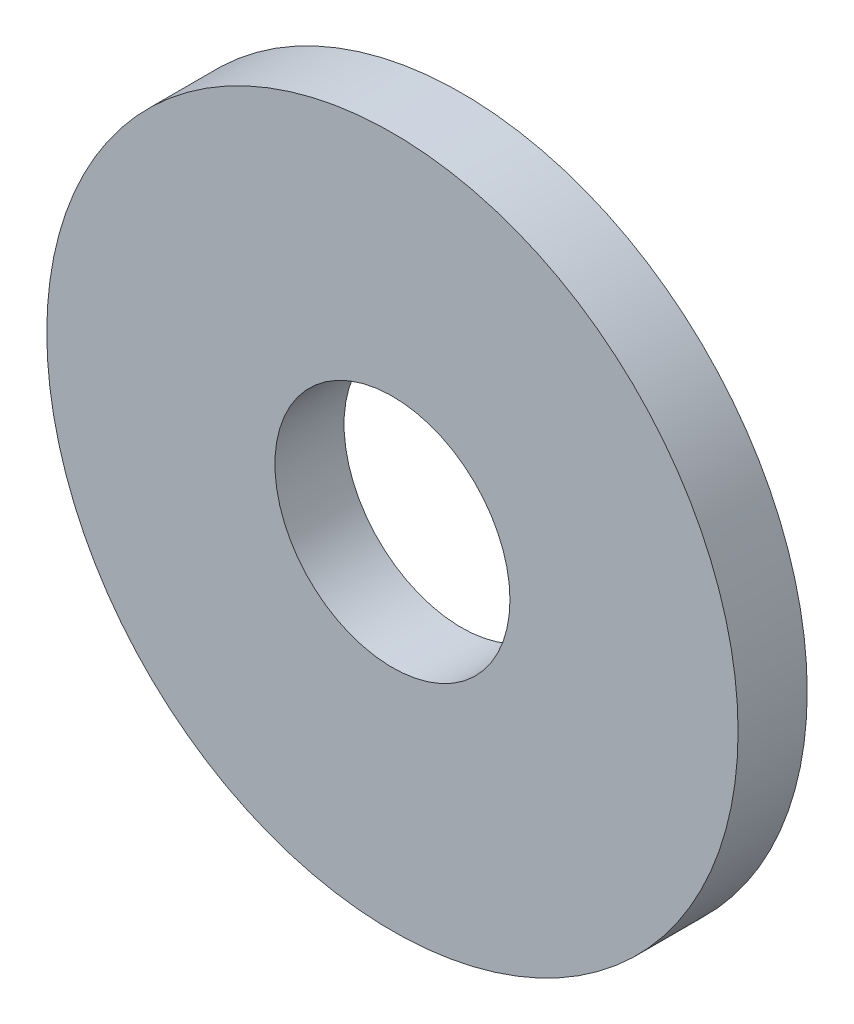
ISO-10303-21;
HEADER;
FILE_DESCRIPTION(('STEP AP214'),'2;1');
FILE_NAME('part.step','',(''),(''),'','','');
FILE_SCHEMA(('AUTOMOTIVE_DESIGN { 1 0 10303 214 1 1 1 1 }'));
ENDSEC;
DATA;
#1=APPLICATION_CONTEXT('core data for automotive mechanical design processes');
#2=APPLICATION_PROTOCOL_DEFINITION('international standard','automotive_design',2000,#1);
#3=PRODUCT_CONTEXT('',#1,'mechanical');
#4=PRODUCT('Part','Part','',(#3));
#5=PRODUCT_RELATED_PRODUCT_CATEGORY('part','',(#4));
#6=PRODUCT_DEFINITION_FORMATION('','',#4);
#7=PRODUCT_DEFINITION_CONTEXT('part definition',#1,'design');
#8=PRODUCT_DEFINITION('design','',#6,#7);
#9=PRODUCT_DEFINITION_SHAPE('','',#8);
#10=(LENGTH_UNIT() NAMED_UNIT(*) SI_UNIT(.MILLI.,.METRE.));
#11=(NAMED_UNIT(*) PLANE_ANGLE_UNIT() SI_UNIT($,.RADIAN.));
#12=(NAMED_UNIT(*) SI_UNIT($,.STERADIAN.) SOLID_ANGLE_UNIT());
#13=UNCERTAINTY_MEASURE_WITH_UNIT(LENGTH_MEASURE(1.E-05),#10,'distance_accuracy_value','');
#14=(GEOMETRIC_REPRESENTATION_CONTEXT(3) GLOBAL_UNCERTAINTY_ASSIGNED_CONTEXT((#13)) GLOBAL_UNIT_ASSIGNED_CONTEXT((#10,
#11,#12)) REPRESENTATION_CONTEXT('',''));
#15=CARTESIAN_POINT('',(0.,0.,0.));
#16=DIRECTION('',(0.,0.,1.));
#17=DIRECTION('',(1.,0.,0.));
#18=AXIS2_PLACEMENT_3D('',#15,#16,#17);
#19=CARTESIAN_POINT('',(0.,0.,5.));
#20=DIRECTION('',(0.,0.,1.));
#21=DIRECTION('',(1.,0.,0.));
#22=AXIS2_PLACEMENT_3D('',#19,#20,#21);
#23=PLANE('',#22);
#24=CARTESIAN_POINT('',(0.,0.,5.));
#25=DIRECTION('',(0.,0.,1.));
#26=DIRECTION('',(1.,0.,0.));
#27=AXIS2_PLACEMENT_3D('',#24,#25,#26);
#28=CIRCLE('',#27,25.);
#29=CARTESIAN_POINT('',(25.,0.,5.));
#30=VERTEX_POINT('',#29);
#31=EDGE_CURVE('E8',#30,#30,#28,.T.);
#32=ORIENTED_EDGE('',*,*,#31,.T.);
#33=EDGE_LOOP('',(#32));
#34=FACE_BOUND('',#33,.T.);
#35=CARTESIAN_POINT('',(0.,0.,5.));
#36=DIRECTION('',(0.,0.,1.));
#37=DIRECTION('',(1.,0.,0.));
#38=AXIS2_PLACEMENT_3D('',#35,#36,#37);
#39=CIRCLE('',#38,8.5);
#40=CARTESIAN_POINT('',(8.5,0.,5.));
#41=VERTEX_POINT('',#40);
#42=EDGE_CURVE('E23',#41,#41,#39,.T.);
#43=ORIENTED_EDGE('',*,*,#42,.F.);
#44=EDGE_LOOP('',(#43));
#45=FACE_BOUND('',#44,.T.);
#46=ADVANCED_FACE('F12',(#34,#45),#23,.T.);
#47=CARTESIAN_POINT('',(0.,0.,0.));
#48=DIRECTION('',(0.,0.,1.));
#49=DIRECTION('',(1.,0.,0.));
#50=AXIS2_PLACEMENT_3D('',#47,#48,#49);
#51=PLANE('',#50);
#52=CARTESIAN_POINT('',(0.,0.,0.));
#53=DIRECTION('',(0.,0.,1.));
#54=DIRECTION('',(1.,0.,0.));
#55=AXIS2_PLACEMENT_3D('',#52,#53,#54);
#56=CIRCLE('',#55,25.);
#57=CARTESIAN_POINT('',(25.,0.,0.));
#58=VERTEX_POINT('',#57);
#59=EDGE_CURVE('E19',#58,#58,#56,.T.);
#60=ORIENTED_EDGE('',*,*,#59,.F.);
#61=EDGE_LOOP('',(#60));
#62=FACE_BOUND('',#61,.T.);
#63=CARTESIAN_POINT('',(0.,0.,0.));
#64=DIRECTION('',(0.,0.,1.));
#65=DIRECTION('',(1.,0.,0.));
#66=AXIS2_PLACEMENT_3D('',#63,#64,#65);
#67=CIRCLE('',#66,8.5);
#68=CARTESIAN_POINT('',(8.5,0.,0.));
#69=VERTEX_POINT('',#68);
#70=EDGE_CURVE('E27',#69,#69,#67,.T.);
#71=ORIENTED_EDGE('',*,*,#70,.T.);
#72=EDGE_LOOP('',(#71));
#73=FACE_BOUND('',#72,.T.);
#74=ADVANCED_FACE('F33',(#62,#73),#51,.F.);
#75=CARTESIAN_POINT('',(0.,0.,5.));
#76=DIRECTION('',(0.,0.,-1.));
#77=DIRECTION('',(-1.,0.,0.));
#78=AXIS2_PLACEMENT_3D('',#75,#76,#77);
#79=CYLINDRICAL_SURFACE('',#78,25.);
#80=ORIENTED_EDGE('',*,*,#31,.F.);
#81=EDGE_LOOP('',(#80));
#82=FACE_BOUND('',#81,.T.);
#83=ORIENTED_EDGE('',*,*,#59,.T.);
#84=EDGE_LOOP('',(#83));
#85=FACE_BOUND('',#84,.T.);
#86=ADVANCED_FACE('F14',(#82,#85),#79,.T.);
#87=CARTESIAN_POINT('',(0.,0.,5.));
#88=DIRECTION('',(0.,0.,-1.));
#89=DIRECTION('',(-1.,0.,0.));
#90=AXIS2_PLACEMENT_3D('',#87,#88,#89);
#91=CYLINDRICAL_SURFACE('',#90,8.5);
#92=ORIENTED_EDGE('',*,*,#42,.T.);
#93=EDGE_LOOP('',(#92));
#94=FACE_BOUND('',#93,.T.);
#95=ORIENTED_EDGE('',*,*,#70,.F.);
#96=EDGE_LOOP('',(#95));
#97=FACE_BOUND('',#96,.T.);
#98=ADVANCED_FACE('F35',(#94,#97),#91,.F.);
#99=CLOSED_SHELL('',(#46,#74,#86,#98));
#100=MANIFOLD_SOLID_BREP('B1',#99);
#101=ADVANCED_BREP_SHAPE_REPRESENTATION('',(#18,#100),#14);
#102=SHAPE_DEFINITION_REPRESENTATION(#9,#101);
ENDSEC;
END-ISO-10303-21;
